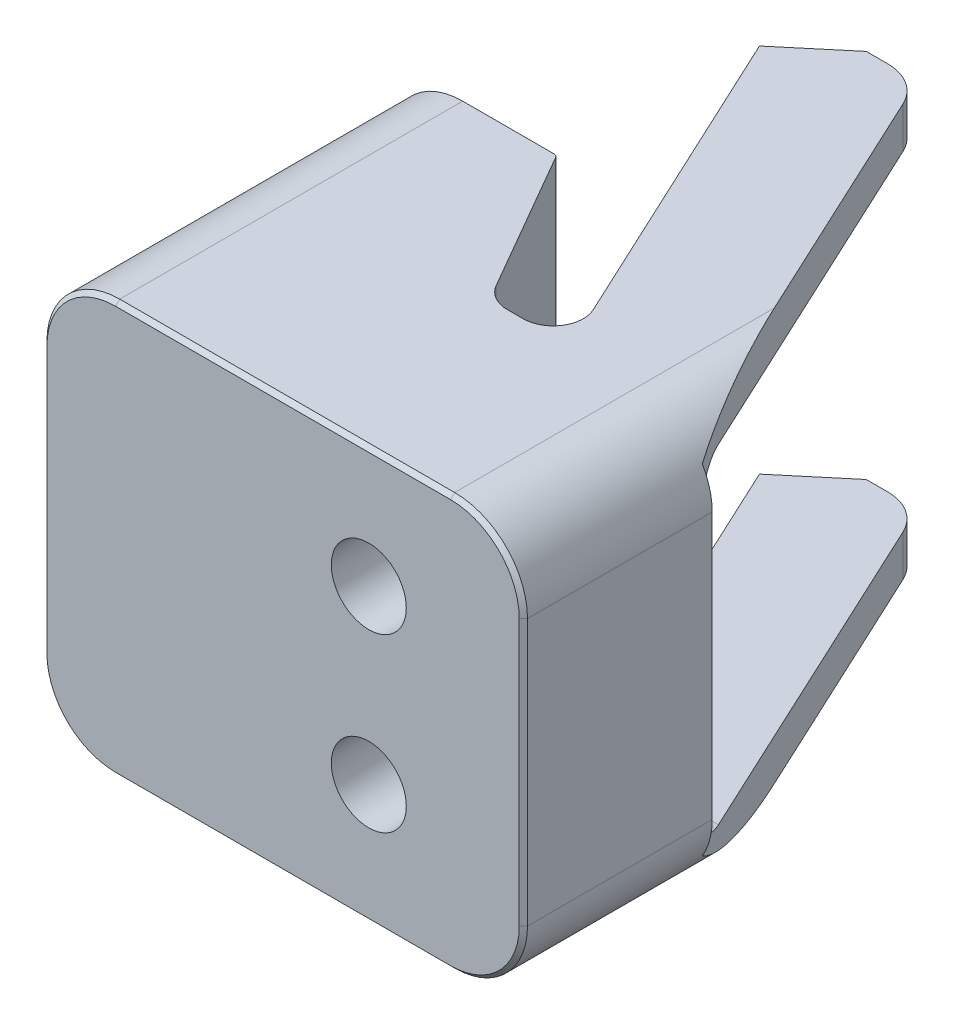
from build123d import *

# Parameters (mm, degrees)
SKETCH1_W          = 109.474
SKETCH1_H          = 76.1746
EXTRUDE1_DEPTH     = 88.8746
CUT_EXTRUDE1_DEPTH = 63.5
FILLET2_R          = 13.462
CHAMFER1_SIZE      = 0.762
CUT_EXTRUDE2_DEPTH = 63.5
FILLET3_R          = 8.636
FILLET5_R          = 5.5626
FILLET6_R          = 5.5626
SKETCH4_W          = 101.6
SKETCH4_H          = 60.96
CUT_EXTRUDE3_DEPTH = 36.83
FILLET7_R          = 5.5626
CUT_EXTRUDE4_DEPTH = 60.96
FILLET8_R          = 0.762


with BuildPart() as part:
    # Sketch1 → Extrude1 (new body)
    with BuildSketch(Plane(origin=(0, 0, 0), x_dir=(0, 0, -1), z_dir=(1, 0, 0))):
        with Locations((54.737, 0)):
            Rectangle(SKETCH1_W, SKETCH1_H)
    extrude(amount=-EXTRUDE1_DEPTH)

    # Sketch2 → Cut-Extrude1 (cut, symmetric)
    with BuildSketch(Plane(origin=(0, 0, 0), x_dir=(1, 0, 0), z_dir=(0, 1, 0))):
        Polygon((0, 34.925), (-1.824386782, 34.925), (-49.201244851, 136.525), (0, 136.525), align=None)
    extrude(amount=CUT_EXTRUDE1_DEPTH, both=True, mode=Mode.SUBTRACT)

    # Fillet2
    fillet2_edges = [part.edges().sort_by_distance(p)[0] for p in [
        (-88.8746, 38.0873, -54.737),
        (-88.8746, -38.0873, -54.737),
        (0, 38.0873, -17.4625),
        (0, -38.0873, -17.4625),
    ]]
    fillet(fillet2_edges, radius=FILLET2_R)

    # Chamfer1
    chamfer1_edges = [part.edges().sort_by_distance(p)[0] for p in [
        (-44.4373, 38.0873, 0),
        (0, 0, 0),
        (-88.8746, 0, 0),
        (-44.4373, -38.0873, 0),
        (-3.942928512, -34.144371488, 0),
        (-3.942928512, 34.144371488, 0),
        (-84.931671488, -34.144371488, 0),
        (-84.931671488, 34.144371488, 0),
    ]]
    chamfer(chamfer1_edges, length=CHAMFER1_SIZE)

    # Sketch3 → Cut-Extrude2 (cut, symmetric)
    with BuildSketch(Plane(origin=(0, 0, 0), x_dir=(1, 0, 0), z_dir=(0, 1, 0))):
        Polygon((-26.234857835, 34.925), (-56.794868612, 100.461154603), (-40.739741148, 113.933006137), (-107.011483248, 113.933006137), (-107.011483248, 64.1858), (-58.03705471, 64.1858), (-41.143323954, 34.925), align=None)
    extrude(amount=CUT_EXTRUDE2_DEPTH, both=True, mode=Mode.SUBTRACT)

    # Fillet3
    fillet3_edges = [part.edges().sort_by_distance(p)[0] for p in [
        (-36.58715639, 0, -109.474),
    ]]
    fillet(fillet3_edges, radius=FILLET3_R)

    # Fillet5
    fillet5_edges = [part.edges().sort_by_distance(p)[0] for p in [
        (-26.234857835, 0, -34.925),
    ]]
    fillet(fillet5_edges, radius=FILLET5_R)

    # Fillet6
    fillet6_edges = [part.edges().sort_by_distance(p)[0] for p in [
        (-41.143323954, 0, -34.925),
    ]]
    fillet(fillet6_edges, radius=FILLET6_R)

    # Sketch4 → Cut-Extrude3 (cut)
    with BuildSketch(Plane(origin=(0, 0, 0), x_dir=(0, 0, -1), z_dir=(1, 0, 0))):
        with Locations((85.725, 0)):
            Rectangle(SKETCH4_W, SKETCH4_H)
    extrude(amount=-CUT_EXTRUDE3_DEPTH, mode=Mode.SUBTRACT)

    # Fillet7
    fillet7_edges = [part.edges().sort_by_distance(p)[0] for p in [
        (-18.395388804, -30.48, -34.925),
        (-18.395388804, 30.48, -34.925),
    ]]
    fillet(fillet7_edges, radius=FILLET7_R)

    # Sketch5 → Cut-Extrude4 (cut)
    with BuildSketch(Plane.XZ.offset(-30.48)):
        Polygon((-15.699612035, -54.306152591), (-47.638594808, -54.306152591), (-82.647006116, -126.286463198), (-15.699612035, -126.286463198), align=None)
    extrude(amount=CUT_EXTRUDE4_DEPTH, mode=Mode.SUBTRACT)

    # Sketch6 → Cut-Revolve1 (revolve, cut)
    with BuildSketch(Plane(origin=(0, -15.875, 0), x_dir=(-1, 0, 0), z_dir=(0, 1, 0)), mode=Mode.PRIVATE) as cut_revolve1_sk:
        Polygon((28.5877, -42.266616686), (18.669, -42.266616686), (18.669, -21.463), (21.6535, -21.463), (21.6535, 33.933383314), (28.5877, 33.933383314), align=None)
    cut_revolve1 = revolve(cut_revolve1_sk.sketch.rotate(Axis((-28.5877, -15.875, -9.585174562), (0, 0, 1)), 180), axis=Axis((-28.5877, -15.875, -9.585174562), (0, 0, 1)), mode=Mode.SUBTRACT)

    # Mirror1: Cut-Revolve1 across plane
    add(cut_revolve1.mirror(Plane.ZX), mode=Mode.SUBTRACT)

    # Fillet8
    fillet8_edges = [part.edges().sort_by_distance(p)[0] for p in [
        (-58.03705471, 0, -64.1858),
    ]]
    fillet(fillet8_edges, radius=FILLET8_R)


solid = part.part
